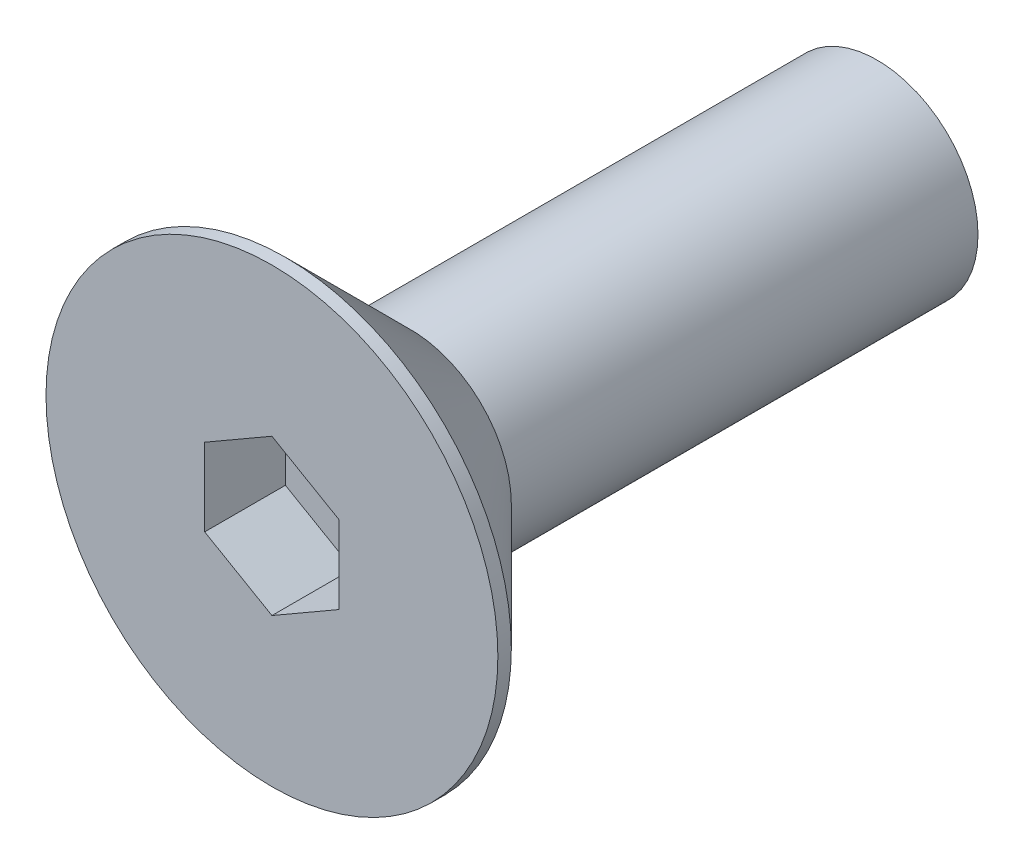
ISO-10303-21;
HEADER;
FILE_DESCRIPTION(('STEP AP214'),'2;1');
FILE_NAME('part.step','',(''),(''),'','','');
FILE_SCHEMA(('AUTOMOTIVE_DESIGN { 1 0 10303 214 1 1 1 1 }'));
ENDSEC;
DATA;
#1=APPLICATION_CONTEXT('core data for automotive mechanical design processes');
#2=APPLICATION_PROTOCOL_DEFINITION('international standard','automotive_design',2000,#1);
#3=PRODUCT_CONTEXT('',#1,'mechanical');
#4=PRODUCT('Part','Part','',(#3));
#5=PRODUCT_RELATED_PRODUCT_CATEGORY('part','',(#4));
#6=PRODUCT_DEFINITION_FORMATION('','',#4);
#7=PRODUCT_DEFINITION_CONTEXT('part definition',#1,'design');
#8=PRODUCT_DEFINITION('design','',#6,#7);
#9=PRODUCT_DEFINITION_SHAPE('','',#8);
#10=(LENGTH_UNIT() NAMED_UNIT(*) SI_UNIT(.MILLI.,.METRE.));
#11=(NAMED_UNIT(*) PLANE_ANGLE_UNIT() SI_UNIT($,.RADIAN.));
#12=(NAMED_UNIT(*) SI_UNIT($,.STERADIAN.) SOLID_ANGLE_UNIT());
#13=UNCERTAINTY_MEASURE_WITH_UNIT(LENGTH_MEASURE(1.E-05),#10,'distance_accuracy_value','');
#14=(GEOMETRIC_REPRESENTATION_CONTEXT(3) GLOBAL_UNCERTAINTY_ASSIGNED_CONTEXT((#13)) GLOBAL_UNIT_ASSIGNED_CONTEXT((#10,
#11,#12)) REPRESENTATION_CONTEXT('',''));
#15=CARTESIAN_POINT('',(0.,0.,0.));
#16=DIRECTION('',(0.,0.,1.));
#17=DIRECTION('',(1.,0.,0.));
#18=AXIS2_PLACEMENT_3D('',#15,#16,#17);
#19=CARTESIAN_POINT('',(0.,0.,0.));
#20=DIRECTION('',(0.,0.,-1.));
#21=DIRECTION('',(-1.,0.,0.));
#22=AXIS2_PLACEMENT_3D('',#19,#20,#21);
#23=PLANE('',#22);
#24=DIRECTION('',(-0.866025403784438,0.5,0.));
#25=VECTOR('',#24,1.);
#26=CARTESIAN_POINT('',(1.,0.577350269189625,0.));
#27=LINE('',#26,#25);
#28=CARTESIAN_POINT('',(1.,0.577350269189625,0.));
#29=VERTEX_POINT('',#28);
#30=CARTESIAN_POINT('',(0.,1.15470053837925,0.));
#31=VERTEX_POINT('',#30);
#32=EDGE_CURVE('E102',#29,#31,#27,.T.);
#33=ORIENTED_EDGE('',*,*,#32,.F.);
#34=DIRECTION('',(0.,1.,0.));
#35=VECTOR('',#34,1.);
#36=CARTESIAN_POINT('',(1.,-0.577350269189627,0.));
#37=LINE('',#36,#35);
#38=CARTESIAN_POINT('',(1.,-0.577350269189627,0.));
#39=VERTEX_POINT('',#38);
#40=EDGE_CURVE('E28',#39,#29,#37,.T.);
#41=ORIENTED_EDGE('',*,*,#40,.F.);
#42=DIRECTION('',(0.866025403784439,0.5,0.));
#43=VECTOR('',#42,1.);
#44=CARTESIAN_POINT('',(0.,-1.15470053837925,0.));
#45=LINE('',#44,#43);
#46=CARTESIAN_POINT('',(0.,-1.15470053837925,0.));
#47=VERTEX_POINT('',#46);
#48=EDGE_CURVE('E111',#47,#39,#45,.T.);
#49=ORIENTED_EDGE('',*,*,#48,.F.);
#50=DIRECTION('',(0.866025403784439,-0.5,0.));
#51=VECTOR('',#50,1.);
#52=CARTESIAN_POINT('',(-1.,-0.577350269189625,0.));
#53=LINE('',#52,#51);
#54=CARTESIAN_POINT('',(-1.,-0.577350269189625,0.));
#55=VERTEX_POINT('',#54);
#56=EDGE_CURVE('E109',#55,#47,#53,.T.);
#57=ORIENTED_EDGE('',*,*,#56,.F.);
#58=DIRECTION('',(0.,-1.,0.));
#59=VECTOR('',#58,1.);
#60=CARTESIAN_POINT('',(-1.,0.577350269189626,0.));
#61=LINE('',#60,#59);
#62=CARTESIAN_POINT('',(-1.,0.577350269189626,0.));
#63=VERTEX_POINT('',#62);
#64=EDGE_CURVE('E76',#63,#55,#61,.T.);
#65=ORIENTED_EDGE('',*,*,#64,.F.);
#66=DIRECTION('',(-0.866025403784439,-0.5,0.));
#67=VECTOR('',#66,1.);
#68=CARTESIAN_POINT('',(0.,1.15470053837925,0.));
#69=LINE('',#68,#67);
#70=EDGE_CURVE('E105',#31,#63,#69,.T.);
#71=ORIENTED_EDGE('',*,*,#70,.F.);
#72=EDGE_LOOP('',(#33,#41,#49,#57,#65,#71));
#73=FACE_BOUND('',#72,.T.);
#74=CARTESIAN_POINT('',(0.,0.,0.));
#75=DIRECTION('',(0.,0.,1.));
#76=DIRECTION('',(1.,0.,0.));
#77=AXIS2_PLACEMENT_3D('',#74,#75,#76);
#78=CIRCLE('',#77,3.36);
#79=CARTESIAN_POINT('',(3.36,0.,0.));
#80=VERTEX_POINT('',#79);
#81=EDGE_CURVE('E9',#80,#80,#78,.T.);
#82=ORIENTED_EDGE('',*,*,#81,.T.);
#83=EDGE_LOOP('',(#82));
#84=FACE_BOUND('',#83,.T.);
#85=ADVANCED_FACE('F14',(#73,#84),#23,.F.);
#86=CARTESIAN_POINT('',(0.,0.,59.72602345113));
#87=DIRECTION('',(0.,0.,1.));
#88=DIRECTION('',(1.,0.,0.));
#89=AXIS2_PLACEMENT_3D('',#86,#87,#88);
#90=CYLINDRICAL_SURFACE('',#89,3.36);
#91=ORIENTED_EDGE('',*,*,#81,.F.);
#92=EDGE_LOOP('',(#91));
#93=FACE_BOUND('',#92,.T.);
#94=CARTESIAN_POINT('',(0.,0.,-0.2));
#95=DIRECTION('',(0.,0.,1.));
#96=DIRECTION('',(1.,0.,0.));
#97=AXIS2_PLACEMENT_3D('',#94,#95,#96);
#98=CIRCLE('',#97,3.36);
#99=CARTESIAN_POINT('',(3.36,0.,-0.2));
#100=VERTEX_POINT('',#99);
#101=EDGE_CURVE('E21',#100,#100,#98,.T.);
#102=ORIENTED_EDGE('',*,*,#101,.T.);
#103=EDGE_LOOP('',(#102));
#104=FACE_BOUND('',#103,.T.);
#105=ADVANCED_FACE('F128',(#93,#104),#90,.T.);
#106=CARTESIAN_POINT('',(0.,0.,-2.06));
#107=DIRECTION('',(0.,0.,1.));
#108=DIRECTION('',(1.,0.,0.));
#109=AXIS2_PLACEMENT_3D('',#106,#107,#108);
#110=CONICAL_SURFACE('',#109,1.5,0.78539816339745);
#111=ORIENTED_EDGE('',*,*,#101,.F.);
#112=EDGE_LOOP('',(#111));
#113=FACE_BOUND('',#112,.T.);
#114=CARTESIAN_POINT('',(0.,0.,-2.06));
#115=DIRECTION('',(0.,0.,1.));
#116=DIRECTION('',(1.,0.,0.));
#117=AXIS2_PLACEMENT_3D('',#114,#115,#116);
#118=CIRCLE('',#117,1.5);
#119=CARTESIAN_POINT('',(1.5,0.,-2.06));
#120=VERTEX_POINT('',#119);
#121=EDGE_CURVE('E123',#120,#120,#118,.T.);
#122=ORIENTED_EDGE('',*,*,#121,.T.);
#123=EDGE_LOOP('',(#122));
#124=FACE_BOUND('',#123,.T.);
#125=ADVANCED_FACE('F130',(#113,#124),#110,.T.);
#126=CARTESIAN_POINT('',(0.,0.,59.72602345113));
#127=DIRECTION('',(0.,0.,1.));
#128=DIRECTION('',(1.,0.,0.));
#129=AXIS2_PLACEMENT_3D('',#126,#127,#128);
#130=CYLINDRICAL_SURFACE('',#129,1.5);
#131=ORIENTED_EDGE('',*,*,#121,.F.);
#132=EDGE_LOOP('',(#131));
#133=FACE_BOUND('',#132,.T.);
#134=CARTESIAN_POINT('',(0.,0.,-9.));
#135=DIRECTION('',(0.,0.,1.));
#136=DIRECTION('',(1.,0.,0.));
#137=AXIS2_PLACEMENT_3D('',#134,#135,#136);
#138=CIRCLE('',#137,1.5);
#139=CARTESIAN_POINT('',(1.5,0.,-9.));
#140=VERTEX_POINT('',#139);
#141=EDGE_CURVE('E115',#140,#140,#138,.T.);
#142=ORIENTED_EDGE('',*,*,#141,.T.);
#143=EDGE_LOOP('',(#142));
#144=FACE_BOUND('',#143,.T.);
#145=ADVANCED_FACE('F133',(#133,#144),#130,.T.);
#146=CARTESIAN_POINT('',(-1.5,0.,-9.));
#147=DIRECTION('',(0.,0.,1.));
#148=DIRECTION('',(1.,0.,0.));
#149=AXIS2_PLACEMENT_3D('',#146,#147,#148);
#150=PLANE('',#149);
#151=ORIENTED_EDGE('',*,*,#141,.F.);
#152=EDGE_LOOP('',(#151));
#153=FACE_BOUND('',#152,.T.);
#154=ADVANCED_FACE('F139',(#153),#150,.F.);
#155=CARTESIAN_POINT('',(1.,-0.577350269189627,-1.2));
#156=DIRECTION('',(1.,0.,0.));
#157=DIRECTION('',(0.,0.,-1.));
#158=AXIS2_PLACEMENT_3D('',#155,#156,#157);
#159=PLANE('',#158);
#160=ORIENTED_EDGE('',*,*,#40,.T.);
#161=DIRECTION('',(0.,0.,1.));
#162=VECTOR('',#161,1.);
#163=CARTESIAN_POINT('',(1.,0.577350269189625,-1.2));
#164=LINE('',#163,#162);
#165=CARTESIAN_POINT('',(1.,0.577350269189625,-1.2));
#166=VERTEX_POINT('',#165);
#167=EDGE_CURVE('E58',#166,#29,#164,.T.);
#168=ORIENTED_EDGE('',*,*,#167,.F.);
#169=DIRECTION('',(0.,1.,0.));
#170=VECTOR('',#169,1.);
#171=CARTESIAN_POINT('',(1.,-0.577350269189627,-1.2));
#172=LINE('',#171,#170);
#173=CARTESIAN_POINT('',(1.,-0.577350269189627,-1.2));
#174=VERTEX_POINT('',#173);
#175=EDGE_CURVE('E113',#174,#166,#172,.T.);
#176=ORIENTED_EDGE('',*,*,#175,.F.);
#177=DIRECTION('',(0.,0.,1.));
#178=VECTOR('',#177,1.);
#179=CARTESIAN_POINT('',(1.,-0.577350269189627,-1.2));
#180=LINE('',#179,#178);
#181=EDGE_CURVE('E36',#174,#39,#180,.T.);
#182=ORIENTED_EDGE('',*,*,#181,.T.);
#183=EDGE_LOOP('',(#160,#168,#176,#182));
#184=FACE_BOUND('',#183,.T.);
#185=ADVANCED_FACE('F144',(#184),#159,.F.);
#186=CARTESIAN_POINT('',(0.,-1.15470053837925,-1.2));
#187=DIRECTION('',(0.5,-0.866025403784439,0.));
#188=DIRECTION('',(-0.866025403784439,-0.5,0.));
#189=AXIS2_PLACEMENT_3D('',#186,#187,#188);
#190=PLANE('',#189);
#191=ORIENTED_EDGE('',*,*,#48,.T.);
#192=ORIENTED_EDGE('',*,*,#181,.F.);
#193=DIRECTION('',(0.866025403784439,0.5,0.));
#194=VECTOR('',#193,1.);
#195=CARTESIAN_POINT('',(0.,-1.15470053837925,-1.2));
#196=LINE('',#195,#194);
#197=CARTESIAN_POINT('',(0.,-1.15470053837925,-1.2));
#198=VERTEX_POINT('',#197);
#199=EDGE_CURVE('E88',#198,#174,#196,.T.);
#200=ORIENTED_EDGE('',*,*,#199,.F.);
#201=DIRECTION('',(0.,0.,1.));
#202=VECTOR('',#201,1.);
#203=CARTESIAN_POINT('',(0.,-1.15470053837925,-1.2));
#204=LINE('',#203,#202);
#205=EDGE_CURVE('E80',#198,#47,#204,.T.);
#206=ORIENTED_EDGE('',*,*,#205,.T.);
#207=EDGE_LOOP('',(#191,#192,#200,#206));
#208=FACE_BOUND('',#207,.T.);
#209=ADVANCED_FACE('F150',(#208),#190,.F.);
#210=CARTESIAN_POINT('',(-1.,-0.577350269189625,-1.2));
#211=DIRECTION('',(-0.5,-0.866025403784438,0.));
#212=DIRECTION('',(-0.866025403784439,0.5,0.));
#213=AXIS2_PLACEMENT_3D('',#210,#211,#212);
#214=PLANE('',#213);
#215=ORIENTED_EDGE('',*,*,#56,.T.);
#216=ORIENTED_EDGE('',*,*,#205,.F.);
#217=DIRECTION('',(0.866025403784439,-0.5,0.));
#218=VECTOR('',#217,1.);
#219=CARTESIAN_POINT('',(-1.,-0.577350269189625,-1.2));
#220=LINE('',#219,#218);
#221=CARTESIAN_POINT('',(-1.,-0.577350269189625,-1.2));
#222=VERTEX_POINT('',#221);
#223=EDGE_CURVE('E84',#222,#198,#220,.T.);
#224=ORIENTED_EDGE('',*,*,#223,.F.);
#225=DIRECTION('',(0.,0.,1.));
#226=VECTOR('',#225,1.);
#227=CARTESIAN_POINT('',(-1.,-0.577350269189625,-1.2));
#228=LINE('',#227,#226);
#229=EDGE_CURVE('E69',#222,#55,#228,.T.);
#230=ORIENTED_EDGE('',*,*,#229,.T.);
#231=EDGE_LOOP('',(#215,#216,#224,#230));
#232=FACE_BOUND('',#231,.T.);
#233=ADVANCED_FACE('F85',(#232),#214,.F.);
#234=CARTESIAN_POINT('',(-1.,0.577350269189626,-1.2));
#235=DIRECTION('',(-1.,0.,0.));
#236=DIRECTION('',(0.,1.,0.));
#237=AXIS2_PLACEMENT_3D('',#234,#235,#236);
#238=PLANE('',#237);
#239=ORIENTED_EDGE('',*,*,#64,.T.);
#240=ORIENTED_EDGE('',*,*,#229,.F.);
#241=DIRECTION('',(0.,-1.,0.));
#242=VECTOR('',#241,1.);
#243=CARTESIAN_POINT('',(-1.,0.577350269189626,-1.2));
#244=LINE('',#243,#242);
#245=CARTESIAN_POINT('',(-1.,0.577350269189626,-1.2));
#246=VERTEX_POINT('',#245);
#247=EDGE_CURVE('E73',#246,#222,#244,.T.);
#248=ORIENTED_EDGE('',*,*,#247,.F.);
#249=DIRECTION('',(0.,0.,1.));
#250=VECTOR('',#249,1.);
#251=CARTESIAN_POINT('',(-1.,0.577350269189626,-1.2));
#252=LINE('',#251,#250);
#253=EDGE_CURVE('E81',#246,#63,#252,.T.);
#254=ORIENTED_EDGE('',*,*,#253,.T.);
#255=EDGE_LOOP('',(#239,#240,#248,#254));
#256=FACE_BOUND('',#255,.T.);
#257=ADVANCED_FACE('F71',(#256),#238,.F.);
#258=CARTESIAN_POINT('',(0.,1.15470053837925,-1.2));
#259=DIRECTION('',(-0.5,0.866025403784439,0.));
#260=DIRECTION('',(0.866025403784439,0.5,0.));
#261=AXIS2_PLACEMENT_3D('',#258,#259,#260);
#262=PLANE('',#261);
#263=ORIENTED_EDGE('',*,*,#70,.T.);
#264=ORIENTED_EDGE('',*,*,#253,.F.);
#265=DIRECTION('',(-0.866025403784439,-0.5,0.));
#266=VECTOR('',#265,1.);
#267=CARTESIAN_POINT('',(0.,1.15470053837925,-1.2));
#268=LINE('',#267,#266);
#269=CARTESIAN_POINT('',(0.,1.15470053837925,-1.2));
#270=VERTEX_POINT('',#269);
#271=EDGE_CURVE('E94',#270,#246,#268,.T.);
#272=ORIENTED_EDGE('',*,*,#271,.F.);
#273=DIRECTION('',(0.,0.,1.));
#274=VECTOR('',#273,1.);
#275=CARTESIAN_POINT('',(0.,1.15470053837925,-1.2));
#276=LINE('',#275,#274);
#277=EDGE_CURVE('E118',#270,#31,#276,.T.);
#278=ORIENTED_EDGE('',*,*,#277,.T.);
#279=EDGE_LOOP('',(#263,#264,#272,#278));
#280=FACE_BOUND('',#279,.T.);
#281=ADVANCED_FACE('F176',(#280),#262,.F.);
#282=CARTESIAN_POINT('',(1.,0.577350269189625,-1.2));
#283=DIRECTION('',(0.5,0.866025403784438,0.));
#284=DIRECTION('',(0.866025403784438,-0.5,0.));
#285=AXIS2_PLACEMENT_3D('',#282,#283,#284);
#286=PLANE('',#285);
#287=ORIENTED_EDGE('',*,*,#32,.T.);
#288=ORIENTED_EDGE('',*,*,#277,.F.);
#289=DIRECTION('',(-0.866025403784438,0.5,0.));
#290=VECTOR('',#289,1.);
#291=CARTESIAN_POINT('',(1.,0.577350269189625,-1.2));
#292=LINE('',#291,#290);
#293=EDGE_CURVE('E96',#166,#270,#292,.T.);
#294=ORIENTED_EDGE('',*,*,#293,.F.);
#295=ORIENTED_EDGE('',*,*,#167,.T.);
#296=EDGE_LOOP('',(#287,#288,#294,#295));
#297=FACE_BOUND('',#296,.T.);
#298=ADVANCED_FACE('F164',(#297),#286,.F.);
#299=CARTESIAN_POINT('',(0.,0.,-1.2));
#300=DIRECTION('',(0.,0.,1.));
#301=DIRECTION('',(1.,0.,0.));
#302=AXIS2_PLACEMENT_3D('',#299,#300,#301);
#303=PLANE('',#302);
#304=ORIENTED_EDGE('',*,*,#175,.T.);
#305=ORIENTED_EDGE('',*,*,#293,.T.);
#306=ORIENTED_EDGE('',*,*,#271,.T.);
#307=ORIENTED_EDGE('',*,*,#247,.T.);
#308=ORIENTED_EDGE('',*,*,#223,.T.);
#309=ORIENTED_EDGE('',*,*,#199,.T.);
#310=EDGE_LOOP('',(#304,#305,#306,#307,#308,#309));
#311=FACE_BOUND('',#310,.T.);
#312=ADVANCED_FACE('F91',(#311),#303,.T.);
#313=CLOSED_SHELL('',(#85,#105,#125,#145,#154,#185,#209,#233,#257,#281,#298,#312));
#314=MANIFOLD_SOLID_BREP('B1',#313);
#315=ADVANCED_BREP_SHAPE_REPRESENTATION('',(#18,#314),#14);
#316=SHAPE_DEFINITION_REPRESENTATION(#9,#315);
ENDSEC;
END-ISO-10303-21;
